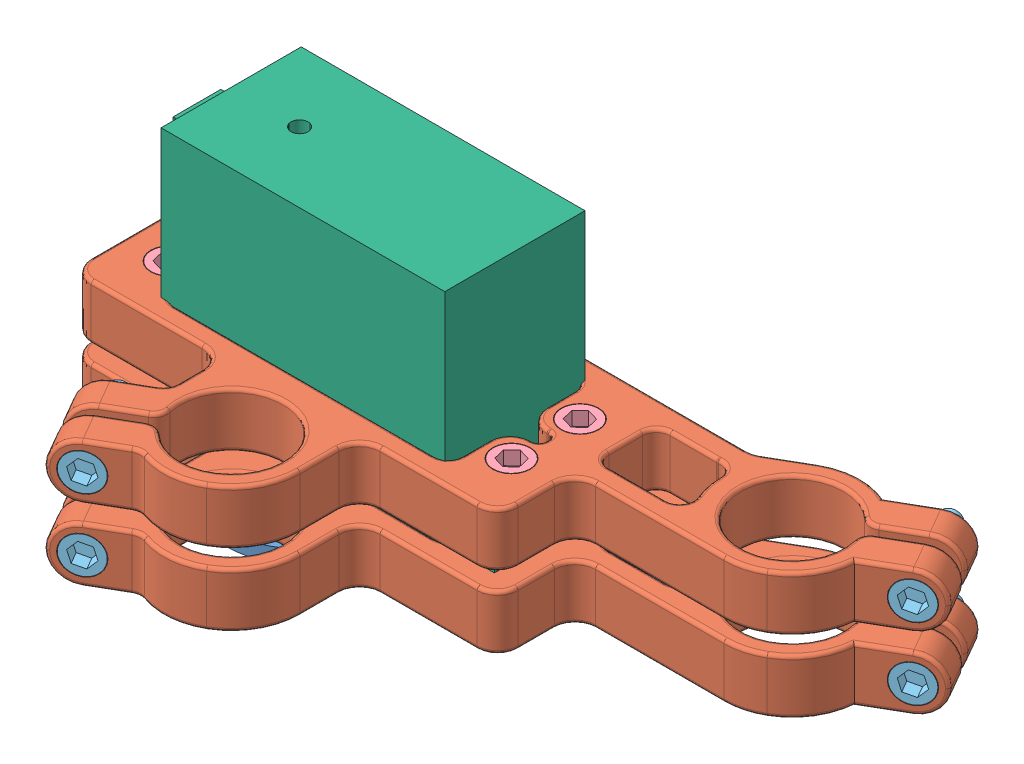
SolidWorks assembly Servo-Asm-R.SLDASM, configuration Default (file format 7000). Lengths in mm.
Overall size (115.17 49.5 98.53).
21 component instances, 7 part files, 41 mates.
Components (placement in the parent):
- Servo SM-S4303R - SmallWheel1-1: Servo SM-S4303R - SmallWheel1.SLDPRT [Default] at (-0.5 -26.5 -0.2887) x (-0.837169 0 -0.546944) z (-0.546944 0 0.837169) size (21 5.7 21)
- Servo Mount-1: Servo Mount.SLDPRT [Default] at (37.5 -8 6.6395) x (0 1 0) z (-0.866025 0 0.5) size (8 55.49 100.95)
- Servo Mount-3: Servo Mount.SLDPRT [Default] at (37.5 -18.5 6.6395) x (0 1 0) z (-0.866025 0 0.5) size (8 55.49 100.95)
- M3 Nut-1: M3 Nut.SLDPRT [Default] at (35.5 -18.5 -5.2887) size (5.5 2.3 6.35)
- M3 Nut-2: M3 Nut.SLDPRT [Default] at (35.5 -18.5 4.7113) size (5.5 2.3 6.35)
- M3 Nut-3: M3 Nut.SLDPRT [Default] at (-14.5 -18.5 -5.2887) size (5.5 2.3 6.35)
- M3 Nut-4: M3 Nut.SLDPRT [Default] at (-14.5 -18.5 4.7113) size (5.5 2.3 6.35)
- M3x16-1: M3x16.SLDPRT [Default] at (35.5 -3 4.7113) x (-0.837169 0 -0.546944) z (-0.546944 0 0.837169) size (5.35 19 5.35)
- M3x16-2: M3x16.SLDPRT [Default] at (-14.5 -3 4.7113) x (-0.837169 0 -0.546944) z (-0.546944 0 0.837169) size (5.35 19 5.35)
- M3x16-3: M3x16.SLDPRT [Default] at (-14.5 -3 -5.2887) x (-0.837169 0 -0.546944) z (-0.546944 0 0.837169) size (5.35 19 5.35)
- M3x16-4: M3x16.SLDPRT [Default] at (35.5 -3 -5.2887) x (-0.837169 0 -0.546944) z (-0.546944 0 0.837169) size (5.35 19 5.35)
- M3 Nut-5: M3 Nut.SLDPRT [Default] at (-3.8806 -14.5 23.8911) x (0.75 -0.5 -0.433013) z (-0.433013 -0.866025 0.25) size (5.5 2.3 6.35)
- M3 Nut-6: M3 Nut.SLDPRT [Default] at (-3.8806 -4 23.8911) x (0.75 -0.5 -0.433013) z (-0.433013 -0.866025 0.25) size (5.5 2.3 6.35)
- M3 Nut-7: M3 Nut.SLDPRT [Default] at (73.1306 -14.5 -20.5713) x (0.75 -0.5 -0.433013) z (-0.433013 -0.866025 0.25) size (5.5 2.3 6.35)
- M3 Nut-8: M3 Nut.SLDPRT [Default] at (73.1306 -4 -20.5713) x (0.75 -0.5 -0.433013) z (-0.433013 -0.866025 0.25) size (5.5 2.3 6.35)
- M3x12-1: M3x12.SLDPRT [Default] at (0.3694 -4 31.2523) x (0.75 0.5 -0.433013) z (-0.433013 0.866025 0.25) size (5.35 15 5.35)
- M3x12-2: M3x12.SLDPRT [Default] at (0.3694 -14.5 31.2523) x (0.75 0.5 -0.433013) z (-0.433013 0.866025 0.25) size (5.35 15 5.35)
- M3x12-3: M3x12.SLDPRT [Default] at (77.3806 -14.5 -13.2101) x (0.75 0.5 -0.433013) z (-0.433013 0.866025 0.25) size (5.35 15 5.35)
- M3x12-4: M3x12.SLDPRT [Default] at (77.3806 -4 -13.2101) x (0.75 0.5 -0.433013) z (-0.433013 0.866025 0.25) size (5.35 15 5.35)
- Servo SM-S4303R-2: Servo SM-S4303R.SLDPRT [Default] at (-0.5 -18.5 -0.2887) x (1 0 0) z (0 0 -1) size (56 46 20.51)
- Servo Screw-1: Servo Screw.SLDPRT [Default] at (-0.5 -23.5 -0.2887) x (-0.837169 0 -0.546944) z (-0.546944 0 0.837169) size (4 4.5 4)
Mates (geometry in assembly coordinates):
- Concentric4: concentric aligned: cylinder of Servo Mount-1 through (63.4808 0 -8.3605) axis (0 -1 0) radius 7.5; cylinder of Servo Mount-3 through (63.4808 -10.5 -8.3605) axis (0 -1 0) radius 7.5
- Concentric5: concentric aligned: cylinder of Servo Mount-1 through (11.5192 0 21.6395) axis (0 -1 0) radius 7.5; cylinder of Servo Mount-3 through (11.5192 -10.5 21.6395) axis (0 -1 0) radius 7.5
- Coincident7: coincident aligned: plane of M3x16-3 through (-14.5 -3 -5.2887) normal (0 -1 0); plane of M3x16-4 through (35.5 -3 -5.2887) normal (0 -1 0)
- Coincident8: coincident aligned: plane of M3x16-2 through (-14.5 -3 4.7113) normal (0 -1 0); plane of M3x16-3 through (-14.5 -3 -5.2887) normal (0 -1 0)
- Coincident9: coincident aligned: plane of M3x16-1 through (35.5 -3 4.7113) normal (0 -1 0); plane of M3x16-2 through (-14.5 -3 4.7113) normal (0 -1 0)
- Coincident10: coincident anti-aligned: circle of Servo Mount-1; plane of M3x16-4 through (35.5 -3 -5.2887) normal (0 -1 0)
- Concentric6: concentric anti-aligned: cylinder of Servo Mount-1 through (35.5 -3 -5.2887) axis (0 1 0) radius 2.75; cylinder of M3x16-4 through (35.5 0 -5.2887) axis (0 -1 0) radius 2.675
- Concentric7: concentric anti-aligned: cylinder of Servo Mount-1 through (-14.5 -3 -5.2887) axis (0 1 0) radius 2.75; cylinder of M3x16-3 through (-14.5 0 -5.2887) axis (0 -1 0) radius 2.675
- Concentric8: concentric anti-aligned: cylinder of Servo Mount-1 through (-14.5 -3 4.7113) axis (0 1 0) radius 2.75; cylinder of M3x16-2 through (-14.5 0 4.7113) axis (0 -1 0) radius 2.675
- Concentric9: concentric anti-aligned: cylinder of Servo Mount-1 through (35.5 -3 4.7113) axis (0 1 0) radius 2.75; cylinder of M3x16-1 through (35.5 0 4.7113) axis (0 -1 0) radius 2.675
- Coincident11: coincident aligned: plane of M3 Nut-1 through (35.5 -18.5 -5.2887) normal (0 -1 0); plane of M3 Nut-3 through (-14.5 -18.5 -5.2887) normal (0 -1 0)
- Coincident12: coincident aligned: plane of M3 Nut-2 through (35.5 -18.5 4.7113) normal (0 -1 0); plane of M3 Nut-3 through (-14.5 -18.5 -5.2887) normal (0 -1 0)
- Coincident13: coincident aligned: plane of M3 Nut-2 through (35.5 -18.5 4.7113) normal (0 -1 0); plane of M3 Nut-4 through (-14.5 -18.5 4.7113) normal (0 -1 0)
- Coincident14: coincident aligned: plane of Servo Mount-3 through (37.5 -18.5 6.6395) normal (0 -1 0); plane of M3 Nut-1 through (35.5 -18.5 -5.2887) normal (0 -1 0)
- Concentric10: concentric anti-aligned: circle of M3 Nut-1; circle of M3x16-4
- Concentric11: concentric anti-aligned: circle of M3 Nut-3; circle of M3x16-3
- Concentric12: concentric anti-aligned: circle of M3 Nut-2; circle of M3x16-1
- Concentric13: concentric anti-aligned: circle of M3 Nut-4; circle of M3x16-2
- Coincident16: coincident aligned: plane of M3x12-3 through (78.8806 -14.5 -10.612) normal (0.5 0 0.866025); plane of M3x12-4 through (78.8806 -4 -10.612) normal (0.5 0 0.866025)
- Coincident17: coincident aligned: plane of Servo Mount-1 through (40.375 -8 11.6192) normal (0.5 0 0.866025); plane of M3x12-3 through (78.8806 -14.5 -10.612) normal (0.5 0 0.866025)
- Concentric14: concentric anti-aligned: cylinder of Servo Mount-1 through (77.3806 -4 -13.2101) axis (0.5 0 0.866025) radius 2.75; cylinder of M3x12-4 through (78.8806 -4 -10.612) axis (-0.5 0 -0.866025) radius 2.675
- Concentric15: concentric anti-aligned: cylinder of Servo Mount-3 through (77.3806 -14.5 -13.2101) axis (0.5 0 0.866025) radius 2.75; cylinder of M3x12-3 through (78.8806 -14.5 -10.612) axis (-0.5 0 -0.866025) radius 2.675
- Coincident18: coincident anti-aligned: plane of M3 Nut-7 through (73.1306 -14.5 -20.5713) normal (-0.5 0 -0.866025); circle of M3 Nut-8
- Coincident19: coincident aligned: plane of Servo Mount-3 through (34.625 -18.5 1.6599) normal (-0.5 0 -0.866025); plane of M3 Nut-7 through (73.1306 -14.5 -20.5713) normal (-0.5 0 -0.866025)
- Concentric16: concentric anti-aligned: circle of M3 Nut-7; circle of M3x12-3
- Concentric17: concentric anti-aligned: circle of M3 Nut-8; circle of M3x12-4
- Coincident21: coincident aligned: circle of M3x12-1; plane of M3x12-2 through (1.8694 -14.5 33.8504) normal (0.5 0 0.866025)
- Coincident22: coincident aligned: plane of Servo Mount-3 through (40.375 -18.5 11.6192) normal (0.5 0 0.866025); plane of M3x12-2 through (1.8694 -14.5 33.8504) normal (0.5 0 0.866025)
- Concentric18: concentric anti-aligned: cylinder of Servo Mount-3 through (0.3694 -14.5 31.2523) axis (0.5 0 0.866025) radius 2.75; cylinder of M3x12-2 through (1.8694 -14.5 33.8504) axis (-0.5 0 -0.866025) radius 2.675
- Concentric19: concentric anti-aligned: cylinder of Servo Mount-1 through (0.3694 -4 31.2523) axis (0.5 0 0.866025) radius 2.75; cylinder of M3x12-1 through (1.8694 -4 33.8504) axis (-0.5 0 -0.866025) radius 2.675
- Coincident23: coincident aligned: plane of M3 Nut-5 through (-3.8806 -14.5 23.8911) normal (-0.5 0 -0.866025); plane of M3 Nut-6 through (-3.8806 -4 23.8911) normal (-0.5 0 -0.866025)
- Coincident24: coincident aligned: plane of Servo Mount-3 through (34.625 -18.5 1.6599) normal (-0.5 0 -0.866025); plane of M3 Nut-6 through (-3.8806 -4 23.8911) normal (-0.5 0 -0.866025)
- Concentric20: concentric anti-aligned: circle of M3 Nut-5; circle of M3x12-2
- Concentric21: concentric anti-aligned: circle of M3 Nut-6; circle of M3x12-1
- Coincident25: coincident anti-aligned: plane of Servo Mount-3 through (37.5 -10.5 6.6395) normal (0 1 0); plane of Servo SM-S4303R-2 through (-0.5 -10.5 -0.2887) normal (0 -1 0)
- Coincident26: coincident anti-aligned: plane of Servo Mount-3 through (31.5 -10.5 -10.5387) normal (0 0 1); plane of Servo SM-S4303R-2 through (-10.5 21.5 -10.5387) normal (0 0 -1)
- Coincident27: coincident anti-aligned: plane of Servo Mount-3 through (-10.5 -10.5 -10.5387) normal (1 0 0); plane of Servo SM-S4303R-2 through (-10.5 21.5 9.9613) normal (-1 0 0)
- Coincident28: coincident anti-aligned: plane of Servo SM-S4303R - SmallWheel1-1 through (-0.5 -24.5 -0.2887) normal (0 1 0); plane of Servo SM-S4303R-2 through (-0.5 -24.5 -0.2887) normal (0 -1 0)
- Concentric24: concentric anti-aligned: cylinder of Servo SM-S4303R - SmallWheel1-1 through (-0.5 -24.5 -0.2887) axis (0 -1 0) radius 1.5; cylinder of Servo SM-S4303R-2 through (-0.5 -24.5 -0.2887) axis (0 1 0) radius 1.25
- Concentric27: concentric anti-aligned: cylinder of Servo SM-S4303R - SmallWheel1-1 through (-0.5 -24.5 -0.2887) axis (0 -1 0) radius 1.5; cylinder of Servo Screw-1 through (-0.5 -26.5 -0.2887) axis (0 1 0) radius 1
- Coincident32: coincident anti-aligned: plane of Servo SM-S4303R - SmallWheel1-1 through (-0.5 -26.5 -0.2887) normal (0 -1 0); plane of Servo Screw-1 through (-0.5 -26.5 -0.2887) normal (0 1 0)
